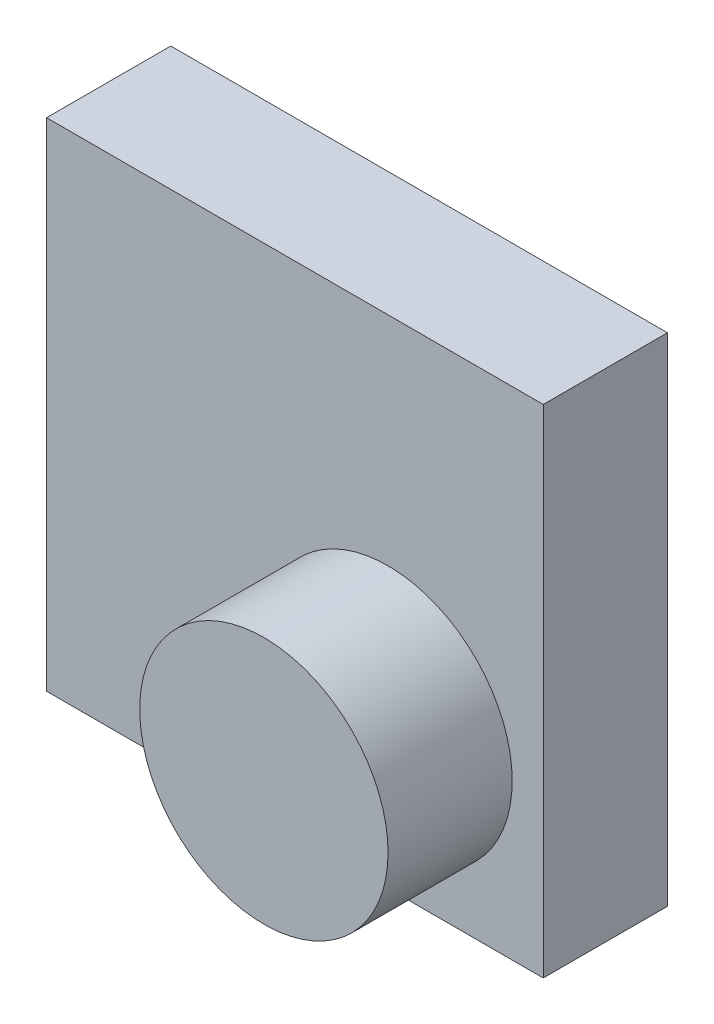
ISO-10303-21;
HEADER;
FILE_DESCRIPTION(('STEP AP214'),'2;1');
FILE_NAME('part.step','',(''),(''),'','','');
FILE_SCHEMA(('AUTOMOTIVE_DESIGN { 1 0 10303 214 1 1 1 1 }'));
ENDSEC;
DATA;
#1=APPLICATION_CONTEXT('core data for automotive mechanical design processes');
#2=APPLICATION_PROTOCOL_DEFINITION('international standard','automotive_design',2000,#1);
#3=PRODUCT_CONTEXT('',#1,'mechanical');
#4=PRODUCT('Part','Part','',(#3));
#5=PRODUCT_RELATED_PRODUCT_CATEGORY('part','',(#4));
#6=PRODUCT_DEFINITION_FORMATION('','',#4);
#7=PRODUCT_DEFINITION_CONTEXT('part definition',#1,'design');
#8=PRODUCT_DEFINITION('design','',#6,#7);
#9=PRODUCT_DEFINITION_SHAPE('','',#8);
#10=(LENGTH_UNIT() NAMED_UNIT(*) SI_UNIT(.MILLI.,.METRE.));
#11=(NAMED_UNIT(*) PLANE_ANGLE_UNIT() SI_UNIT($,.RADIAN.));
#12=(NAMED_UNIT(*) SI_UNIT($,.STERADIAN.) SOLID_ANGLE_UNIT());
#13=UNCERTAINTY_MEASURE_WITH_UNIT(LENGTH_MEASURE(1.E-05),#10,'distance_accuracy_value','');
#14=(GEOMETRIC_REPRESENTATION_CONTEXT(3) GLOBAL_UNCERTAINTY_ASSIGNED_CONTEXT((#13)) GLOBAL_UNIT_ASSIGNED_CONTEXT((#10,
#11,#12)) REPRESENTATION_CONTEXT('',''));
#15=CARTESIAN_POINT('',(0.,0.,0.));
#16=DIRECTION('',(0.,0.,1.));
#17=DIRECTION('',(1.,0.,0.));
#18=AXIS2_PLACEMENT_3D('',#15,#16,#17);
#19=CARTESIAN_POINT('',(0.,0.,12.7));
#20=DIRECTION('',(0.,0.,1.));
#21=DIRECTION('',(1.,0.,0.));
#22=AXIS2_PLACEMENT_3D('',#19,#20,#21);
#23=PLANE('',#22);
#24=DIRECTION('',(0.,-1.,0.));
#25=VECTOR('',#24,1.);
#26=CARTESIAN_POINT('',(-50.8,50.8,12.7));
#27=LINE('',#26,#25);
#28=CARTESIAN_POINT('',(-50.8,50.8,12.7));
#29=VERTEX_POINT('',#28);
#30=CARTESIAN_POINT('',(-50.8,-50.8,12.7));
#31=VERTEX_POINT('',#30);
#32=EDGE_CURVE('E85',#29,#31,#27,.T.);
#33=ORIENTED_EDGE('',*,*,#32,.T.);
#34=DIRECTION('',(1.,0.,0.));
#35=VECTOR('',#34,1.);
#36=CARTESIAN_POINT('',(-50.8,-50.8,12.7));
#37=LINE('',#36,#35);
#38=CARTESIAN_POINT('',(50.8,-50.8,12.7));
#39=VERTEX_POINT('',#38);
#40=EDGE_CURVE('E80',#31,#39,#37,.T.);
#41=ORIENTED_EDGE('',*,*,#40,.T.);
#42=DIRECTION('',(0.,1.,0.));
#43=VECTOR('',#42,1.);
#44=CARTESIAN_POINT('',(50.8,50.8,12.7));
#45=LINE('',#44,#43);
#46=CARTESIAN_POINT('',(50.8,50.8,12.7));
#47=VERTEX_POINT('',#46);
#48=EDGE_CURVE('E83',#39,#47,#45,.T.);
#49=ORIENTED_EDGE('',*,*,#48,.T.);
#50=DIRECTION('',(-1.,0.,0.));
#51=VECTOR('',#50,1.);
#52=CARTESIAN_POINT('',(-50.8,50.8,12.7));
#53=LINE('',#52,#51);
#54=EDGE_CURVE('E50',#47,#29,#53,.T.);
#55=ORIENTED_EDGE('',*,*,#54,.T.);
#56=EDGE_LOOP('',(#33,#41,#49,#55));
#57=FACE_BOUND('',#56,.T.);
#58=CARTESIAN_POINT('',(19.05,-19.05,12.7));
#59=DIRECTION('',(0.,0.,1.));
#60=DIRECTION('',(1.,0.,0.));
#61=AXIS2_PLACEMENT_3D('',#58,#59,#60);
#62=CIRCLE('',#61,25.4);
#63=CARTESIAN_POINT('',(44.45,-19.05,12.7));
#64=VERTEX_POINT('',#63);
#65=EDGE_CURVE('E111',#64,#64,#62,.T.);
#66=ORIENTED_EDGE('',*,*,#65,.F.);
#67=EDGE_LOOP('',(#66));
#68=FACE_BOUND('',#67,.T.);
#69=ADVANCED_FACE('F33',(#57,#68),#23,.T.);
#70=CARTESIAN_POINT('',(-50.8,50.8,12.7));
#71=DIRECTION('',(1.,0.,0.));
#72=DIRECTION('',(0.,1.,0.));
#73=AXIS2_PLACEMENT_3D('',#70,#71,#72);
#74=PLANE('',#73);
#75=DIRECTION('',(0.,-1.,0.));
#76=VECTOR('',#75,1.);
#77=CARTESIAN_POINT('',(-50.8,50.8,-12.7));
#78=LINE('',#77,#76);
#79=CARTESIAN_POINT('',(-50.8,50.8,-12.7));
#80=VERTEX_POINT('',#79);
#81=CARTESIAN_POINT('',(-50.8,-50.8,-12.7));
#82=VERTEX_POINT('',#81);
#83=EDGE_CURVE('E97',#80,#82,#78,.T.);
#84=ORIENTED_EDGE('',*,*,#83,.T.);
#85=DIRECTION('',(0.,0.,-1.));
#86=VECTOR('',#85,1.);
#87=CARTESIAN_POINT('',(-50.8,-50.8,12.7));
#88=LINE('',#87,#86);
#89=EDGE_CURVE('E11',#31,#82,#88,.T.);
#90=ORIENTED_EDGE('',*,*,#89,.F.);
#91=ORIENTED_EDGE('',*,*,#32,.F.);
#92=DIRECTION('',(0.,0.,-1.));
#93=VECTOR('',#92,1.);
#94=CARTESIAN_POINT('',(-50.8,50.8,12.7));
#95=LINE('',#94,#93);
#96=EDGE_CURVE('E93',#29,#80,#95,.T.);
#97=ORIENTED_EDGE('',*,*,#96,.T.);
#98=EDGE_LOOP('',(#84,#90,#91,#97));
#99=FACE_BOUND('',#98,.T.);
#100=ADVANCED_FACE('F35',(#99),#74,.F.);
#101=CARTESIAN_POINT('',(-50.8,-50.8,12.7));
#102=DIRECTION('',(0.,1.,0.));
#103=DIRECTION('',(-1.,0.,0.));
#104=AXIS2_PLACEMENT_3D('',#101,#102,#103);
#105=PLANE('',#104);
#106=DIRECTION('',(1.,0.,0.));
#107=VECTOR('',#106,1.);
#108=CARTESIAN_POINT('',(-50.8,-50.8,-12.7));
#109=LINE('',#108,#107);
#110=CARTESIAN_POINT('',(50.8,-50.8,-12.7));
#111=VERTEX_POINT('',#110);
#112=EDGE_CURVE('E89',#82,#111,#109,.T.);
#113=ORIENTED_EDGE('',*,*,#112,.T.);
#114=DIRECTION('',(0.,0.,-1.));
#115=VECTOR('',#114,1.);
#116=CARTESIAN_POINT('',(50.8,-50.8,12.7));
#117=LINE('',#116,#115);
#118=EDGE_CURVE('E42',#39,#111,#117,.T.);
#119=ORIENTED_EDGE('',*,*,#118,.F.);
#120=ORIENTED_EDGE('',*,*,#40,.F.);
#121=ORIENTED_EDGE('',*,*,#89,.T.);
#122=EDGE_LOOP('',(#113,#119,#120,#121));
#123=FACE_BOUND('',#122,.T.);
#124=ADVANCED_FACE('F88',(#123),#105,.F.);
#125=CARTESIAN_POINT('',(50.8,50.8,12.7));
#126=DIRECTION('',(-1.,0.,0.));
#127=DIRECTION('',(0.,0.,1.));
#128=AXIS2_PLACEMENT_3D('',#125,#126,#127);
#129=PLANE('',#128);
#130=DIRECTION('',(0.,1.,0.));
#131=VECTOR('',#130,1.);
#132=CARTESIAN_POINT('',(50.8,50.8,-12.7));
#133=LINE('',#132,#131);
#134=CARTESIAN_POINT('',(50.8,50.8,-12.7));
#135=VERTEX_POINT('',#134);
#136=EDGE_CURVE('E67',#111,#135,#133,.T.);
#137=ORIENTED_EDGE('',*,*,#136,.T.);
#138=DIRECTION('',(0.,0.,-1.));
#139=VECTOR('',#138,1.);
#140=CARTESIAN_POINT('',(50.8,50.8,12.7));
#141=LINE('',#140,#139);
#142=EDGE_CURVE('E90',#47,#135,#141,.T.);
#143=ORIENTED_EDGE('',*,*,#142,.F.);
#144=ORIENTED_EDGE('',*,*,#48,.F.);
#145=ORIENTED_EDGE('',*,*,#118,.T.);
#146=EDGE_LOOP('',(#137,#143,#144,#145));
#147=FACE_BOUND('',#146,.T.);
#148=ADVANCED_FACE('F91',(#147),#129,.F.);
#149=CARTESIAN_POINT('',(-50.8,50.8,12.7));
#150=DIRECTION('',(0.,-1.,0.));
#151=DIRECTION('',(0.,0.,-1.));
#152=AXIS2_PLACEMENT_3D('',#149,#150,#151);
#153=PLANE('',#152);
#154=DIRECTION('',(-1.,0.,0.));
#155=VECTOR('',#154,1.);
#156=CARTESIAN_POINT('',(-50.8,50.8,-12.7));
#157=LINE('',#156,#155);
#158=EDGE_CURVE('E73',#135,#80,#157,.T.);
#159=ORIENTED_EDGE('',*,*,#158,.T.);
#160=ORIENTED_EDGE('',*,*,#96,.F.);
#161=ORIENTED_EDGE('',*,*,#54,.F.);
#162=ORIENTED_EDGE('',*,*,#142,.T.);
#163=EDGE_LOOP('',(#159,#160,#161,#162));
#164=FACE_BOUND('',#163,.T.);
#165=ADVANCED_FACE('F105',(#164),#153,.F.);
#166=CARTESIAN_POINT('',(0.,0.,-12.7));
#167=DIRECTION('',(0.,0.,1.));
#168=DIRECTION('',(1.,0.,0.));
#169=AXIS2_PLACEMENT_3D('',#166,#167,#168);
#170=PLANE('',#169);
#171=ORIENTED_EDGE('',*,*,#83,.F.);
#172=ORIENTED_EDGE('',*,*,#158,.F.);
#173=ORIENTED_EDGE('',*,*,#136,.F.);
#174=ORIENTED_EDGE('',*,*,#112,.F.);
#175=EDGE_LOOP('',(#171,#172,#173,#174));
#176=FACE_BOUND('',#175,.T.);
#177=ADVANCED_FACE('F108',(#176),#170,.F.);
#178=CARTESIAN_POINT('',(19.05,-19.05,38.1));
#179=DIRECTION('',(0.,0.,-1.));
#180=DIRECTION('',(-1.,0.,0.));
#181=AXIS2_PLACEMENT_3D('',#178,#179,#180);
#182=CYLINDRICAL_SURFACE('',#181,25.4);
#183=CARTESIAN_POINT('',(19.05,-19.05,38.1));
#184=DIRECTION('',(0.,0.,1.));
#185=DIRECTION('',(1.,0.,0.));
#186=AXIS2_PLACEMENT_3D('',#183,#184,#185);
#187=CIRCLE('',#186,25.4);
#188=CARTESIAN_POINT('',(44.45,-19.05,38.1));
#189=VERTEX_POINT('',#188);
#190=EDGE_CURVE('E100',#189,#189,#187,.T.);
#191=ORIENTED_EDGE('',*,*,#190,.F.);
#192=EDGE_LOOP('',(#191));
#193=FACE_BOUND('',#192,.T.);
#194=ORIENTED_EDGE('',*,*,#65,.T.);
#195=EDGE_LOOP('',(#194));
#196=FACE_BOUND('',#195,.T.);
#197=ADVANCED_FACE('F119',(#193,#196),#182,.T.);
#198=CARTESIAN_POINT('',(19.05,-19.05,38.1));
#199=DIRECTION('',(0.,0.,1.));
#200=DIRECTION('',(1.,0.,0.));
#201=AXIS2_PLACEMENT_3D('',#198,#199,#200);
#202=PLANE('',#201);
#203=ORIENTED_EDGE('',*,*,#190,.T.);
#204=EDGE_LOOP('',(#203));
#205=FACE_BOUND('',#204,.T.);
#206=ADVANCED_FACE('F117',(#205),#202,.T.);
#207=CLOSED_SHELL('',(#69,#100,#124,#148,#165,#177,#197,#206));
#208=MANIFOLD_SOLID_BREP('B2',#207);
#209=ADVANCED_BREP_SHAPE_REPRESENTATION('',(#18,#208),#14);
#210=SHAPE_DEFINITION_REPRESENTATION(#9,#209);
ENDSEC;
END-ISO-10303-21;
